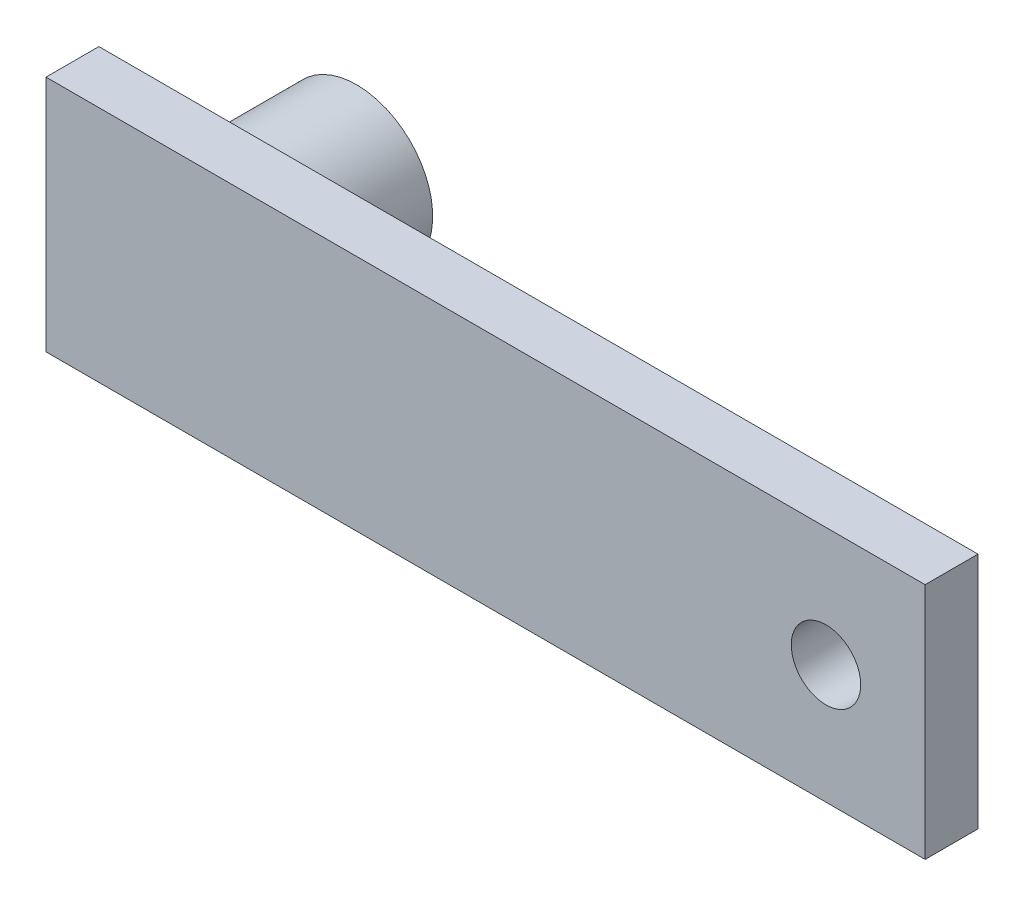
ISO-10303-21;
HEADER;
FILE_DESCRIPTION(('STEP AP214'),'2;1');
FILE_NAME('part.step','',(''),(''),'','','');
FILE_SCHEMA(('AUTOMOTIVE_DESIGN { 1 0 10303 214 1 1 1 1 }'));
ENDSEC;
DATA;
#1=APPLICATION_CONTEXT('core data for automotive mechanical design processes');
#2=APPLICATION_PROTOCOL_DEFINITION('international standard','automotive_design',2000,#1);
#3=PRODUCT_CONTEXT('',#1,'mechanical');
#4=PRODUCT('Part','Part','',(#3));
#5=PRODUCT_RELATED_PRODUCT_CATEGORY('part','',(#4));
#6=PRODUCT_DEFINITION_FORMATION('','',#4);
#7=PRODUCT_DEFINITION_CONTEXT('part definition',#1,'design');
#8=PRODUCT_DEFINITION('design','',#6,#7);
#9=PRODUCT_DEFINITION_SHAPE('','',#8);
#10=(LENGTH_UNIT() NAMED_UNIT(*) SI_UNIT(.MILLI.,.METRE.));
#11=(NAMED_UNIT(*) PLANE_ANGLE_UNIT() SI_UNIT($,.RADIAN.));
#12=(NAMED_UNIT(*) SI_UNIT($,.STERADIAN.) SOLID_ANGLE_UNIT());
#13=UNCERTAINTY_MEASURE_WITH_UNIT(LENGTH_MEASURE(1.E-05),#10,'distance_accuracy_value','');
#14=(GEOMETRIC_REPRESENTATION_CONTEXT(3) GLOBAL_UNCERTAINTY_ASSIGNED_CONTEXT((#13)) GLOBAL_UNIT_ASSIGNED_CONTEXT((#10,
#11,#12)) REPRESENTATION_CONTEXT('',''));
#15=CARTESIAN_POINT('',(0.,0.,0.));
#16=DIRECTION('',(0.,0.,1.));
#17=DIRECTION('',(1.,0.,0.));
#18=AXIS2_PLACEMENT_3D('',#15,#16,#17);
#19=CARTESIAN_POINT('',(11.5,11.5,21.));
#20=DIRECTION('',(0.,-1.,0.));
#21=DIRECTION('',(1.,0.,0.));
#22=AXIS2_PLACEMENT_3D('',#19,#20,#21);
#23=PLANE('',#22);
#24=DIRECTION('',(-1.,0.,0.));
#25=VECTOR('',#24,1.);
#26=CARTESIAN_POINT('',(11.5,11.5,20.));
#27=LINE('',#26,#25);
#28=CARTESIAN_POINT('',(11.5,11.5,20.));
#29=VERTEX_POINT('',#28);
#30=CARTESIAN_POINT('',(0.,11.5,20.));
#31=VERTEX_POINT('',#30);
#32=EDGE_CURVE('E105',#29,#31,#27,.T.);
#33=ORIENTED_EDGE('',*,*,#32,.T.);
#34=CARTESIAN_POINT('',(-11.5,11.5,20.));
#35=VERTEX_POINT('',#34);
#36=EDGE_CURVE('E118',#31,#35,#27,.T.);
#37=ORIENTED_EDGE('',*,*,#36,.T.);
#38=DIRECTION('',(0.,0.,-1.));
#39=VECTOR('',#38,1.);
#40=CARTESIAN_POINT('',(-11.5,11.5,21.));
#41=LINE('',#40,#39);
#42=CARTESIAN_POINT('',(-11.5,11.5,21.));
#43=VERTEX_POINT('',#42);
#44=EDGE_CURVE('E9',#43,#35,#41,.T.);
#45=ORIENTED_EDGE('',*,*,#44,.F.);
#46=DIRECTION('',(-1.,0.,0.));
#47=VECTOR('',#46,1.);
#48=CARTESIAN_POINT('',(11.5,11.5,21.));
#49=LINE('',#48,#47);
#50=CARTESIAN_POINT('',(11.5,11.5,21.));
#51=VERTEX_POINT('',#50);
#52=EDGE_CURVE('E131',#51,#43,#49,.T.);
#53=ORIENTED_EDGE('',*,*,#52,.F.);
#54=DIRECTION('',(0.,0.,-1.));
#55=VECTOR('',#54,1.);
#56=CARTESIAN_POINT('',(11.5,11.5,21.));
#57=LINE('',#56,#55);
#58=EDGE_CURVE('E132',#51,#29,#57,.T.);
#59=ORIENTED_EDGE('',*,*,#58,.T.);
#60=EDGE_LOOP('',(#33,#37,#45,#53,#59));
#61=FACE_BOUND('',#60,.T.);
#62=ADVANCED_FACE('F14',(#61),#23,.F.);
#63=CARTESIAN_POINT('',(-11.5,11.5,21.));
#64=DIRECTION('',(1.,0.,0.));
#65=DIRECTION('',(0.,0.,1.));
#66=AXIS2_PLACEMENT_3D('',#63,#64,#65);
#67=PLANE('',#66);
#68=DIRECTION('',(0.,-1.,0.));
#69=VECTOR('',#68,1.);
#70=CARTESIAN_POINT('',(-11.5,11.5,20.));
#71=LINE('',#70,#69);
#72=CARTESIAN_POINT('',(-11.5,0.,20.));
#73=VERTEX_POINT('',#72);
#74=EDGE_CURVE('E104',#35,#73,#71,.T.);
#75=ORIENTED_EDGE('',*,*,#74,.T.);
#76=CARTESIAN_POINT('',(-11.5,-11.5,20.));
#77=VERTEX_POINT('',#76);
#78=EDGE_CURVE('E95',#73,#77,#71,.T.);
#79=ORIENTED_EDGE('',*,*,#78,.T.);
#80=DIRECTION('',(0.,0.,-1.));
#81=VECTOR('',#80,1.);
#82=CARTESIAN_POINT('',(-11.5,-11.5,21.));
#83=LINE('',#82,#81);
#84=CARTESIAN_POINT('',(-11.5,-11.5,21.));
#85=VERTEX_POINT('',#84);
#86=EDGE_CURVE('E22',#85,#77,#83,.T.);
#87=ORIENTED_EDGE('',*,*,#86,.F.);
#88=DIRECTION('',(0.,-1.,0.));
#89=VECTOR('',#88,1.);
#90=CARTESIAN_POINT('',(-11.5,11.5,21.));
#91=LINE('',#90,#89);
#92=EDGE_CURVE('E141',#43,#85,#91,.T.);
#93=ORIENTED_EDGE('',*,*,#92,.F.);
#94=ORIENTED_EDGE('',*,*,#44,.T.);
#95=EDGE_LOOP('',(#75,#79,#87,#93,#94));
#96=FACE_BOUND('',#95,.T.);
#97=ADVANCED_FACE('F120',(#96),#67,.F.);
#98=CARTESIAN_POINT('',(11.5,-11.5,21.));
#99=DIRECTION('',(0.,1.,0.));
#100=DIRECTION('',(-1.,0.,0.));
#101=AXIS2_PLACEMENT_3D('',#98,#99,#100);
#102=PLANE('',#101);
#103=DIRECTION('',(1.,0.,0.));
#104=VECTOR('',#103,1.);
#105=CARTESIAN_POINT('',(11.5,-11.5,20.));
#106=LINE('',#105,#104);
#107=CARTESIAN_POINT('',(0.,-11.5,20.));
#108=VERTEX_POINT('',#107);
#109=EDGE_CURVE('E100',#77,#108,#106,.T.);
#110=ORIENTED_EDGE('',*,*,#109,.T.);
#111=CARTESIAN_POINT('',(11.5,-11.5,20.));
#112=VERTEX_POINT('',#111);
#113=EDGE_CURVE('E122',#108,#112,#106,.T.);
#114=ORIENTED_EDGE('',*,*,#113,.T.);
#115=DIRECTION('',(0.,0.,-1.));
#116=VECTOR('',#115,1.);
#117=CARTESIAN_POINT('',(11.5,-11.5,21.));
#118=LINE('',#117,#116);
#119=CARTESIAN_POINT('',(11.5,-11.5,21.));
#120=VERTEX_POINT('',#119);
#121=EDGE_CURVE('E37',#120,#112,#118,.T.);
#122=ORIENTED_EDGE('',*,*,#121,.F.);
#123=DIRECTION('',(1.,0.,0.));
#124=VECTOR('',#123,1.);
#125=CARTESIAN_POINT('',(11.5,-11.5,21.));
#126=LINE('',#125,#124);
#127=EDGE_CURVE('E139',#85,#120,#126,.T.);
#128=ORIENTED_EDGE('',*,*,#127,.F.);
#129=ORIENTED_EDGE('',*,*,#86,.T.);
#130=EDGE_LOOP('',(#110,#114,#122,#128,#129));
#131=FACE_BOUND('',#130,.T.);
#132=ADVANCED_FACE('F137',(#131),#102,.F.);
#133=CARTESIAN_POINT('',(11.5,11.5,21.));
#134=DIRECTION('',(-1.,0.,0.));
#135=DIRECTION('',(0.,0.,-1.));
#136=AXIS2_PLACEMENT_3D('',#133,#134,#135);
#137=PLANE('',#136);
#138=DIRECTION('',(0.,1.,0.));
#139=VECTOR('',#138,1.);
#140=CARTESIAN_POINT('',(11.5,11.5,20.));
#141=LINE('',#140,#139);
#142=CARTESIAN_POINT('',(11.5,0.,20.));
#143=VERTEX_POINT('',#142);
#144=EDGE_CURVE('E128',#112,#143,#141,.T.);
#145=ORIENTED_EDGE('',*,*,#144,.T.);
#146=EDGE_CURVE('E127',#143,#29,#141,.T.);
#147=ORIENTED_EDGE('',*,*,#146,.T.);
#148=ORIENTED_EDGE('',*,*,#58,.F.);
#149=DIRECTION('',(0.,1.,0.));
#150=VECTOR('',#149,1.);
#151=CARTESIAN_POINT('',(11.5,11.5,21.));
#152=LINE('',#151,#150);
#153=EDGE_CURVE('E135',#120,#51,#152,.T.);
#154=ORIENTED_EDGE('',*,*,#153,.F.);
#155=ORIENTED_EDGE('',*,*,#121,.T.);
#156=EDGE_LOOP('',(#145,#147,#148,#154,#155));
#157=FACE_BOUND('',#156,.T.);
#158=ADVANCED_FACE('F210',(#157),#137,.F.);
#159=CARTESIAN_POINT('',(-18.,18.,21.));
#160=DIRECTION('',(0.,0.,1.));
#161=DIRECTION('',(0.,-1.,0.));
#162=AXIS2_PLACEMENT_3D('',#159,#160,#161);
#163=PLANE('',#162);
#164=CARTESIAN_POINT('',(100.,0.,21.));
#165=DIRECTION('',(0.,0.,1.));
#166=DIRECTION('',(0.,-1.,0.));
#167=AXIS2_PLACEMENT_3D('',#164,#165,#166);
#168=CIRCLE('',#167,5.25);
#169=CARTESIAN_POINT('',(100.,-5.25,21.));
#170=VERTEX_POINT('',#169);
#171=EDGE_CURVE('E17',#170,#170,#168,.T.);
#172=ORIENTED_EDGE('',*,*,#171,.T.);
#173=EDGE_LOOP('',(#172));
#174=FACE_BOUND('',#173,.T.);
#175=DIRECTION('',(-1.,0.,0.));
#176=VECTOR('',#175,1.);
#177=CARTESIAN_POINT('',(115.,18.,21.));
#178=LINE('',#177,#176);
#179=CARTESIAN_POINT('',(115.,18.,21.));
#180=VERTEX_POINT('',#179);
#181=CARTESIAN_POINT('',(-18.,18.,21.));
#182=VERTEX_POINT('',#181);
#183=EDGE_CURVE('E172',#180,#182,#178,.T.);
#184=ORIENTED_EDGE('',*,*,#183,.F.);
#185=DIRECTION('',(0.,1.,0.));
#186=VECTOR('',#185,1.);
#187=CARTESIAN_POINT('',(115.,18.,21.));
#188=LINE('',#187,#186);
#189=CARTESIAN_POINT('',(115.,-18.,21.));
#190=VERTEX_POINT('',#189);
#191=EDGE_CURVE('E165',#190,#180,#188,.T.);
#192=ORIENTED_EDGE('',*,*,#191,.F.);
#193=DIRECTION('',(1.,0.,0.));
#194=VECTOR('',#193,1.);
#195=CARTESIAN_POINT('',(115.,-18.,21.));
#196=LINE('',#195,#194);
#197=CARTESIAN_POINT('',(-18.,-18.,21.));
#198=VERTEX_POINT('',#197);
#199=EDGE_CURVE('E168',#198,#190,#196,.T.);
#200=ORIENTED_EDGE('',*,*,#199,.F.);
#201=DIRECTION('',(0.,-1.,0.));
#202=VECTOR('',#201,1.);
#203=CARTESIAN_POINT('',(-18.,18.,21.));
#204=LINE('',#203,#202);
#205=EDGE_CURVE('E170',#182,#198,#204,.T.);
#206=ORIENTED_EDGE('',*,*,#205,.F.);
#207=EDGE_LOOP('',(#184,#192,#200,#206));
#208=FACE_BOUND('',#207,.T.);
#209=ORIENTED_EDGE('',*,*,#153,.T.);
#210=ORIENTED_EDGE('',*,*,#52,.T.);
#211=ORIENTED_EDGE('',*,*,#92,.T.);
#212=ORIENTED_EDGE('',*,*,#127,.T.);
#213=EDGE_LOOP('',(#209,#210,#211,#212));
#214=FACE_BOUND('',#213,.T.);
#215=ADVANCED_FACE('F148',(#174,#208,#214),#163,.F.);
#216=CARTESIAN_POINT('',(115.,18.,29.));
#217=DIRECTION('',(0.,-1.,0.));
#218=DIRECTION('',(1.,0.,0.));
#219=AXIS2_PLACEMENT_3D('',#216,#217,#218);
#220=PLANE('',#219);
#221=ORIENTED_EDGE('',*,*,#183,.T.);
#222=DIRECTION('',(0.,0.,-1.));
#223=VECTOR('',#222,1.);
#224=CARTESIAN_POINT('',(-18.,18.,29.));
#225=LINE('',#224,#223);
#226=CARTESIAN_POINT('',(-18.,18.,29.));
#227=VERTEX_POINT('',#226);
#228=EDGE_CURVE('E151',#227,#182,#225,.T.);
#229=ORIENTED_EDGE('',*,*,#228,.F.);
#230=DIRECTION('',(-1.,0.,0.));
#231=VECTOR('',#230,1.);
#232=CARTESIAN_POINT('',(115.,18.,29.));
#233=LINE('',#232,#231);
#234=CARTESIAN_POINT('',(115.,18.,29.));
#235=VERTEX_POINT('',#234);
#236=EDGE_CURVE('E167',#235,#227,#233,.T.);
#237=ORIENTED_EDGE('',*,*,#236,.F.);
#238=DIRECTION('',(0.,0.,-1.));
#239=VECTOR('',#238,1.);
#240=CARTESIAN_POINT('',(115.,18.,29.));
#241=LINE('',#240,#239);
#242=EDGE_CURVE('E161',#235,#180,#241,.T.);
#243=ORIENTED_EDGE('',*,*,#242,.T.);
#244=EDGE_LOOP('',(#221,#229,#237,#243));
#245=FACE_BOUND('',#244,.T.);
#246=ADVANCED_FACE('F216',(#245),#220,.F.);
#247=CARTESIAN_POINT('',(-18.,18.,29.));
#248=DIRECTION('',(1.,0.,0.));
#249=DIRECTION('',(0.,0.,1.));
#250=AXIS2_PLACEMENT_3D('',#247,#248,#249);
#251=PLANE('',#250);
#252=ORIENTED_EDGE('',*,*,#205,.T.);
#253=DIRECTION('',(0.,0.,-1.));
#254=VECTOR('',#253,1.);
#255=CARTESIAN_POINT('',(-18.,-18.,29.));
#256=LINE('',#255,#254);
#257=CARTESIAN_POINT('',(-18.,-18.,29.));
#258=VERTEX_POINT('',#257);
#259=EDGE_CURVE('E155',#258,#198,#256,.T.);
#260=ORIENTED_EDGE('',*,*,#259,.F.);
#261=DIRECTION('',(0.,-1.,0.));
#262=VECTOR('',#261,1.);
#263=CARTESIAN_POINT('',(-18.,18.,29.));
#264=LINE('',#263,#262);
#265=EDGE_CURVE('E178',#227,#258,#264,.T.);
#266=ORIENTED_EDGE('',*,*,#265,.F.);
#267=ORIENTED_EDGE('',*,*,#228,.T.);
#268=EDGE_LOOP('',(#252,#260,#266,#267));
#269=FACE_BOUND('',#268,.T.);
#270=ADVANCED_FACE('F219',(#269),#251,.F.);
#271=CARTESIAN_POINT('',(115.,-18.,29.));
#272=DIRECTION('',(0.,1.,0.));
#273=DIRECTION('',(-1.,0.,0.));
#274=AXIS2_PLACEMENT_3D('',#271,#272,#273);
#275=PLANE('',#274);
#276=ORIENTED_EDGE('',*,*,#199,.T.);
#277=DIRECTION('',(0.,0.,-1.));
#278=VECTOR('',#277,1.);
#279=CARTESIAN_POINT('',(115.,-18.,29.));
#280=LINE('',#279,#278);
#281=CARTESIAN_POINT('',(115.,-18.,29.));
#282=VERTEX_POINT('',#281);
#283=EDGE_CURVE('E158',#282,#190,#280,.T.);
#284=ORIENTED_EDGE('',*,*,#283,.F.);
#285=DIRECTION('',(1.,0.,0.));
#286=VECTOR('',#285,1.);
#287=CARTESIAN_POINT('',(115.,-18.,29.));
#288=LINE('',#287,#286);
#289=EDGE_CURVE('E176',#258,#282,#288,.T.);
#290=ORIENTED_EDGE('',*,*,#289,.F.);
#291=ORIENTED_EDGE('',*,*,#259,.T.);
#292=EDGE_LOOP('',(#276,#284,#290,#291));
#293=FACE_BOUND('',#292,.T.);
#294=ADVANCED_FACE('F223',(#293),#275,.F.);
#295=CARTESIAN_POINT('',(115.,18.,29.));
#296=DIRECTION('',(-1.,0.,0.));
#297=DIRECTION('',(0.,0.,-1.));
#298=AXIS2_PLACEMENT_3D('',#295,#296,#297);
#299=PLANE('',#298);
#300=ORIENTED_EDGE('',*,*,#191,.T.);
#301=ORIENTED_EDGE('',*,*,#242,.F.);
#302=DIRECTION('',(0.,1.,0.));
#303=VECTOR('',#302,1.);
#304=CARTESIAN_POINT('',(115.,18.,29.));
#305=LINE('',#304,#303);
#306=EDGE_CURVE('E164',#282,#235,#305,.T.);
#307=ORIENTED_EDGE('',*,*,#306,.F.);
#308=ORIENTED_EDGE('',*,*,#283,.T.);
#309=EDGE_LOOP('',(#300,#301,#307,#308));
#310=FACE_BOUND('',#309,.T.);
#311=ADVANCED_FACE('F227',(#310),#299,.F.);
#312=CARTESIAN_POINT('',(-18.,18.,29.));
#313=DIRECTION('',(0.,0.,1.));
#314=DIRECTION('',(0.,-1.,0.));
#315=AXIS2_PLACEMENT_3D('',#312,#313,#314);
#316=PLANE('',#315);
#317=CARTESIAN_POINT('',(100.,0.,29.));
#318=DIRECTION('',(0.,0.,1.));
#319=DIRECTION('',(0.,-1.,0.));
#320=AXIS2_PLACEMENT_3D('',#317,#318,#319);
#321=CIRCLE('',#320,5.25);
#322=CARTESIAN_POINT('',(100.,-5.25,29.));
#323=VERTEX_POINT('',#322);
#324=EDGE_CURVE('E119',#323,#323,#321,.T.);
#325=ORIENTED_EDGE('',*,*,#324,.F.);
#326=EDGE_LOOP('',(#325));
#327=FACE_BOUND('',#326,.T.);
#328=ORIENTED_EDGE('',*,*,#236,.T.);
#329=ORIENTED_EDGE('',*,*,#265,.T.);
#330=ORIENTED_EDGE('',*,*,#289,.T.);
#331=ORIENTED_EDGE('',*,*,#306,.T.);
#332=EDGE_LOOP('',(#328,#329,#330,#331));
#333=FACE_BOUND('',#332,.T.);
#334=ADVANCED_FACE('F231',(#327,#333),#316,.T.);
#335=CARTESIAN_POINT('',(100.,0.,29.));
#336=DIRECTION('',(0.,0.,1.));
#337=DIRECTION('',(0.,-1.,0.));
#338=AXIS2_PLACEMENT_3D('',#335,#336,#337);
#339=CYLINDRICAL_SURFACE('',#338,5.25);
#340=ORIENTED_EDGE('',*,*,#324,.T.);
#341=EDGE_LOOP('',(#340));
#342=FACE_BOUND('',#341,.T.);
#343=ORIENTED_EDGE('',*,*,#171,.F.);
#344=EDGE_LOOP('',(#343));
#345=FACE_BOUND('',#344,.T.);
#346=ADVANCED_FACE('F238',(#342,#345),#339,.F.);
#347=CARTESIAN_POINT('',(0.,0.,20.));
#348=DIRECTION('',(0.,0.,-1.));
#349=DIRECTION('',(-1.,0.,0.));
#350=AXIS2_PLACEMENT_3D('',#347,#348,#349);
#351=PLANE('',#350);
#352=ORIENTED_EDGE('',*,*,#78,.F.);
#353=CARTESIAN_POINT('',(0.,0.,20.));
#354=DIRECTION('',(0.,0.,-1.));
#355=DIRECTION('',(-1.,0.,0.));
#356=AXIS2_PLACEMENT_3D('',#353,#354,#355);
#357=CIRCLE('',#356,11.5);
#358=EDGE_CURVE('E98',#108,#73,#357,.T.);
#359=ORIENTED_EDGE('',*,*,#358,.F.);
#360=ORIENTED_EDGE('',*,*,#109,.F.);
#361=EDGE_LOOP('',(#352,#359,#360));
#362=FACE_BOUND('',#361,.T.);
#363=ADVANCED_FACE('F97',(#362),#351,.T.);
#364=ORIENTED_EDGE('',*,*,#74,.F.);
#365=ORIENTED_EDGE('',*,*,#36,.F.);
#366=EDGE_CURVE('E110',#73,#31,#357,.T.);
#367=ORIENTED_EDGE('',*,*,#366,.F.);
#368=EDGE_LOOP('',(#364,#365,#367));
#369=FACE_BOUND('',#368,.T.);
#370=ADVANCED_FACE('F116',(#369),#351,.T.);
#371=ORIENTED_EDGE('',*,*,#32,.F.);
#372=ORIENTED_EDGE('',*,*,#146,.F.);
#373=EDGE_CURVE('E29',#31,#143,#357,.T.);
#374=ORIENTED_EDGE('',*,*,#373,.F.);
#375=EDGE_LOOP('',(#371,#372,#374));
#376=FACE_BOUND('',#375,.T.);
#377=ADVANCED_FACE('F198',(#376),#351,.T.);
#378=ORIENTED_EDGE('',*,*,#113,.F.);
#379=EDGE_CURVE('E112',#143,#108,#357,.T.);
#380=ORIENTED_EDGE('',*,*,#379,.F.);
#381=ORIENTED_EDGE('',*,*,#144,.F.);
#382=EDGE_LOOP('',(#378,#380,#381));
#383=FACE_BOUND('',#382,.T.);
#384=ADVANCED_FACE('F189',(#383),#351,.T.);
#385=CARTESIAN_POINT('',(0.,0.,20.));
#386=DIRECTION('',(0.,0.,-1.));
#387=DIRECTION('',(-1.,0.,0.));
#388=AXIS2_PLACEMENT_3D('',#385,#386,#387);
#389=CYLINDRICAL_SURFACE('',#388,11.5);
#390=ORIENTED_EDGE('',*,*,#366,.T.);
#391=ORIENTED_EDGE('',*,*,#373,.T.);
#392=ORIENTED_EDGE('',*,*,#379,.T.);
#393=ORIENTED_EDGE('',*,*,#358,.T.);
#394=EDGE_LOOP('',(#390,#391,#392,#393));
#395=FACE_BOUND('',#394,.T.);
#396=CARTESIAN_POINT('',(0.,0.,0.));
#397=DIRECTION('',(0.,0.,-1.));
#398=DIRECTION('',(-1.,0.,0.));
#399=AXIS2_PLACEMENT_3D('',#396,#397,#398);
#400=CIRCLE('',#399,11.5);
#401=CARTESIAN_POINT('',(-11.5,0.,0.));
#402=VERTEX_POINT('',#401);
#403=EDGE_CURVE('E113',#402,#402,#400,.T.);
#404=ORIENTED_EDGE('',*,*,#403,.F.);
#405=EDGE_LOOP('',(#404));
#406=FACE_BOUND('',#405,.T.);
#407=ADVANCED_FACE('F108',(#395,#406),#389,.T.);
#408=CARTESIAN_POINT('',(0.,0.,0.));
#409=DIRECTION('',(0.,0.,-1.));
#410=DIRECTION('',(-1.,0.,0.));
#411=AXIS2_PLACEMENT_3D('',#408,#409,#410);
#412=PLANE('',#411);
#413=ORIENTED_EDGE('',*,*,#403,.T.);
#414=EDGE_LOOP('',(#413));
#415=FACE_BOUND('',#414,.T.);
#416=ADVANCED_FACE('F187',(#415),#412,.T.);
#417=CLOSED_SHELL('',(#62,#97,#132,#158,#215,#246,#270,#294,#311,#334,#346,#363,#370,#377,#384,
#407,#416));
#418=MANIFOLD_SOLID_BREP('B1',#417);
#419=ADVANCED_BREP_SHAPE_REPRESENTATION('',(#18,#418),#14);
#420=SHAPE_DEFINITION_REPRESENTATION(#9,#419);
ENDSEC;
END-ISO-10303-21;
